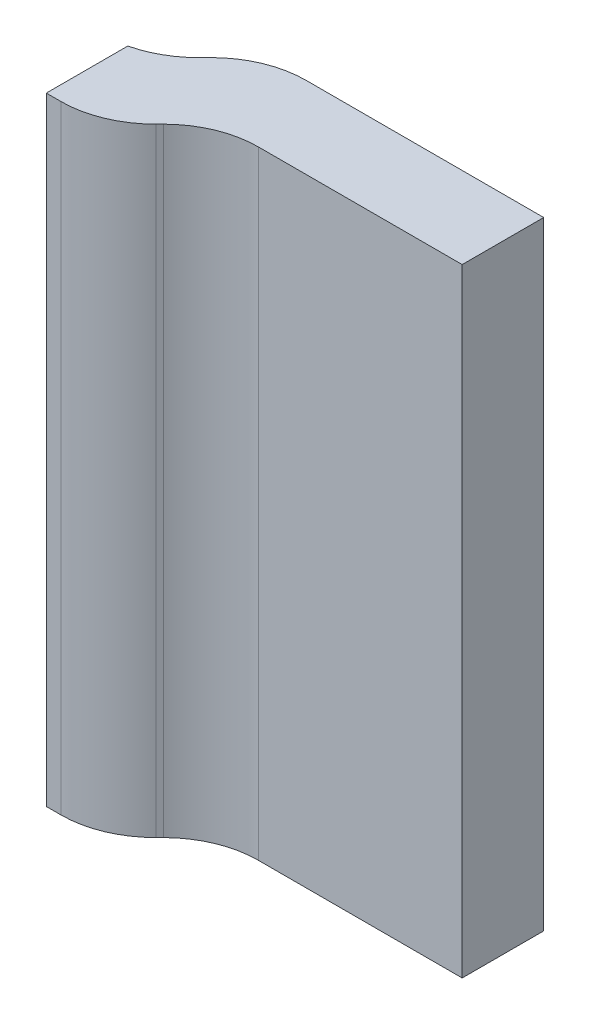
ISO-10303-21;
HEADER;
FILE_DESCRIPTION(('STEP AP214'),'2;1');
FILE_NAME('part.step','',(''),(''),'','','');
FILE_SCHEMA(('AUTOMOTIVE_DESIGN { 1 0 10303 214 1 1 1 1 }'));
ENDSEC;
DATA;
#1=APPLICATION_CONTEXT('core data for automotive mechanical design processes');
#2=APPLICATION_PROTOCOL_DEFINITION('international standard','automotive_design',2000,#1);
#3=PRODUCT_CONTEXT('',#1,'mechanical');
#4=PRODUCT('Part','Part','',(#3));
#5=PRODUCT_RELATED_PRODUCT_CATEGORY('part','',(#4));
#6=PRODUCT_DEFINITION_FORMATION('','',#4);
#7=PRODUCT_DEFINITION_CONTEXT('part definition',#1,'design');
#8=PRODUCT_DEFINITION('design','',#6,#7);
#9=PRODUCT_DEFINITION_SHAPE('','',#8);
#10=(LENGTH_UNIT() NAMED_UNIT(*) SI_UNIT(.MILLI.,.METRE.));
#11=(NAMED_UNIT(*) PLANE_ANGLE_UNIT() SI_UNIT($,.RADIAN.));
#12=(NAMED_UNIT(*) SI_UNIT($,.STERADIAN.) SOLID_ANGLE_UNIT());
#13=UNCERTAINTY_MEASURE_WITH_UNIT(LENGTH_MEASURE(1.E-05),#10,'distance_accuracy_value','');
#14=(GEOMETRIC_REPRESENTATION_CONTEXT(3) GLOBAL_UNCERTAINTY_ASSIGNED_CONTEXT((#13)) GLOBAL_UNIT_ASSIGNED_CONTEXT((#10,
#11,#12)) REPRESENTATION_CONTEXT('',''));
#15=CARTESIAN_POINT('',(0.,0.,0.));
#16=DIRECTION('',(0.,0.,1.));
#17=DIRECTION('',(1.,0.,0.));
#18=AXIS2_PLACEMENT_3D('',#15,#16,#17);
#19=CARTESIAN_POINT('',(2.,0.,1.186));
#20=DIRECTION('',(0.,0.,1.));
#21=DIRECTION('',(1.,0.,0.));
#22=AXIS2_PLACEMENT_3D('',#19,#20,#21);
#23=PLANE('',#22);
#24=DIRECTION('',(0.,1.,0.));
#25=VECTOR('',#24,1.);
#26=CARTESIAN_POINT('',(2.,0.,1.186));
#27=LINE('',#26,#25);
#28=CARTESIAN_POINT('',(2.,0.,1.186));
#29=VERTEX_POINT('',#28);
#30=CARTESIAN_POINT('',(2.,5.2,1.186));
#31=VERTEX_POINT('',#30);
#32=EDGE_CURVE('E117',#29,#31,#27,.T.);
#33=ORIENTED_EDGE('',*,*,#32,.F.);
#34=DIRECTION('',(1.,0.,0.));
#35=VECTOR('',#34,1.);
#36=CARTESIAN_POINT('',(2.,0.,1.186));
#37=LINE('',#36,#35);
#38=CARTESIAN_POINT('',(2.121779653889,0.,1.186));
#39=VERTEX_POINT('',#38);
#40=EDGE_CURVE('E105',#29,#39,#37,.T.);
#41=ORIENTED_EDGE('',*,*,#40,.T.);
#42=DIRECTION('',(0.,1.,0.));
#43=VECTOR('',#42,1.);
#44=CARTESIAN_POINT('',(2.121779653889,0.,1.186));
#45=LINE('',#44,#43);
#46=CARTESIAN_POINT('',(2.121779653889,5.2,1.186));
#47=VERTEX_POINT('',#46);
#48=EDGE_CURVE('E111',#39,#47,#45,.T.);
#49=ORIENTED_EDGE('',*,*,#48,.T.);
#50=DIRECTION('',(1.,0.,0.));
#51=VECTOR('',#50,1.);
#52=CARTESIAN_POINT('',(2.,5.2,1.186));
#53=LINE('',#52,#51);
#54=EDGE_CURVE('E114',#47,#31,#53,.F.);
#55=ORIENTED_EDGE('',*,*,#54,.T.);
#56=EDGE_LOOP('',(#33,#41,#49,#55));
#57=FACE_BOUND('',#56,.T.);
#58=ADVANCED_FACE('F17',(#57),#23,.T.);
#59=CARTESIAN_POINT('',(2.121779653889,0.,0.386));
#60=DIRECTION('',(0.,1.,0.));
#61=DIRECTION('',(0.,0.,1.));
#62=AXIS2_PLACEMENT_3D('',#59,#60,#61);
#63=CYLINDRICAL_SURFACE('',#62,0.8);
#64=DIRECTION('',(0.,1.,0.));
#65=VECTOR('',#64,1.);
#66=CARTESIAN_POINT('',(2.687465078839,0.,0.951685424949));
#67=LINE('',#66,#65);
#68=CARTESIAN_POINT('',(2.68746507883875,5.2,0.95168542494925));
#69=VERTEX_POINT('',#68);
#70=CARTESIAN_POINT('',(2.68746507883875,0.,0.95168542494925));
#71=VERTEX_POINT('',#70);
#72=EDGE_CURVE('E157',#69,#71,#67,.F.);
#73=ORIENTED_EDGE('',*,*,#72,.F.);
#74=CARTESIAN_POINT('',(2.121779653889,5.2,0.386));
#75=DIRECTION('',(0.,1.,0.));
#76=DIRECTION('',(0.,0.,1.));
#77=AXIS2_PLACEMENT_3D('',#74,#75,#76);
#78=CIRCLE('',#77,0.8);
#79=EDGE_CURVE('E98',#69,#47,#78,.F.);
#80=ORIENTED_EDGE('',*,*,#79,.T.);
#81=ORIENTED_EDGE('',*,*,#48,.F.);
#82=CARTESIAN_POINT('',(2.121779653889,0.,0.386));
#83=DIRECTION('',(0.,1.,0.));
#84=DIRECTION('',(0.,0.,1.));
#85=AXIS2_PLACEMENT_3D('',#82,#83,#84);
#86=CIRCLE('',#85,0.8);
#87=EDGE_CURVE('E20',#39,#71,#86,.T.);
#88=ORIENTED_EDGE('',*,*,#87,.T.);
#89=EDGE_LOOP('',(#73,#80,#81,#88));
#90=FACE_BOUND('',#89,.T.);
#91=ADVANCED_FACE('F112',(#90),#63,.T.);
#92=CARTESIAN_POINT('',(2.,0.,0.5));
#93=DIRECTION('',(-1.,0.,0.));
#94=DIRECTION('',(0.,0.,1.));
#95=AXIS2_PLACEMENT_3D('',#92,#93,#94);
#96=PLANE('',#95);
#97=DIRECTION('',(0.,0.,1.));
#98=VECTOR('',#97,1.);
#99=CARTESIAN_POINT('',(2.,5.2,0.5));
#100=LINE('',#99,#98);
#101=CARTESIAN_POINT('',(1.99999999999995,5.2,0.499999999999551));
#102=VERTEX_POINT('',#101);
#103=EDGE_CURVE('E149',#31,#102,#100,.F.);
#104=ORIENTED_EDGE('',*,*,#103,.T.);
#105=DIRECTION('',(0.,1.,0.));
#106=VECTOR('',#105,1.);
#107=CARTESIAN_POINT('',(1.9999999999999,0.,0.499999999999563));
#108=LINE('',#107,#106);
#109=CARTESIAN_POINT('',(1.99999999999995,0.,0.499999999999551));
#110=VERTEX_POINT('',#109);
#111=EDGE_CURVE('E144',#102,#110,#108,.F.);
#112=ORIENTED_EDGE('',*,*,#111,.T.);
#113=DIRECTION('',(0.,0.,1.));
#114=VECTOR('',#113,1.);
#115=CARTESIAN_POINT('',(2.,0.,0.5));
#116=LINE('',#115,#114);
#117=EDGE_CURVE('E145',#110,#29,#116,.T.);
#118=ORIENTED_EDGE('',*,*,#117,.T.);
#119=ORIENTED_EDGE('',*,*,#32,.T.);
#120=EDGE_LOOP('',(#104,#112,#118,#119));
#121=FACE_BOUND('',#120,.T.);
#122=ADVANCED_FACE('F320',(#121),#96,.T.);
#123=CARTESIAN_POINT('',(2.453150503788,0.,1.186));
#124=DIRECTION('',(0.707106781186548,0.,0.707106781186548));
#125=DIRECTION('',(0.707106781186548,0.,-0.707106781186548));
#126=AXIS2_PLACEMENT_3D('',#123,#124,#125);
#127=PLANE('',#126);
#128=DIRECTION('',(0.,1.,0.));
#129=VECTOR('',#128,1.);
#130=CARTESIAN_POINT('',(2.71883592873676,0.,0.920314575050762));
#131=LINE('',#130,#129);
#132=CARTESIAN_POINT('',(2.71883592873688,0.,0.920314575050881));
#133=VERTEX_POINT('',#132);
#134=CARTESIAN_POINT('',(2.71883592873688,5.2,0.920314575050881));
#135=VERTEX_POINT('',#134);
#136=EDGE_CURVE('E142',#133,#135,#131,.T.);
#137=ORIENTED_EDGE('',*,*,#136,.T.);
#138=DIRECTION('',(0.707106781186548,0.,-0.707106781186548));
#139=VECTOR('',#138,1.);
#140=CARTESIAN_POINT('',(2.453150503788,5.2,1.186));
#141=LINE('',#140,#139);
#142=EDGE_CURVE('E162',#135,#69,#141,.F.);
#143=ORIENTED_EDGE('',*,*,#142,.T.);
#144=ORIENTED_EDGE('',*,*,#72,.T.);
#145=DIRECTION('',(0.707106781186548,0.,-0.707106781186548));
#146=VECTOR('',#145,1.);
#147=CARTESIAN_POINT('',(2.453150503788,0.,1.186));
#148=LINE('',#147,#146);
#149=EDGE_CURVE('E108',#71,#133,#148,.T.);
#150=ORIENTED_EDGE('',*,*,#149,.T.);
#151=EDGE_LOOP('',(#137,#143,#144,#150));
#152=FACE_BOUND('',#151,.T.);
#153=ADVANCED_FACE('F310',(#152),#127,.T.);
#154=CARTESIAN_POINT('',(1.816237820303,0.,-0.278608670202));
#155=DIRECTION('',(0.,1.,0.));
#156=DIRECTION('',(0.,0.,1.));
#157=AXIS2_PLACEMENT_3D('',#154,#155,#156);
#158=CYLINDRICAL_SURFACE('',#157,0.8);
#159=DIRECTION('',(0.,1.,0.));
#160=VECTOR('',#159,1.);
#161=CARTESIAN_POINT('',(2.381923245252,0.,0.287076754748));
#162=LINE('',#161,#160);
#163=CARTESIAN_POINT('',(2.38192324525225,0.,0.28707675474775));
#164=VERTEX_POINT('',#163);
#165=CARTESIAN_POINT('',(2.38192324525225,5.2,0.28707675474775));
#166=VERTEX_POINT('',#165);
#167=EDGE_CURVE('E171',#164,#166,#162,.T.);
#168=ORIENTED_EDGE('',*,*,#167,.F.);
#169=CARTESIAN_POINT('',(1.816237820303,0.,-0.278608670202));
#170=DIRECTION('',(0.,1.,0.));
#171=DIRECTION('',(0.,0.,1.));
#172=AXIS2_PLACEMENT_3D('',#169,#170,#171);
#173=CIRCLE('',#172,0.8);
#174=EDGE_CURVE('E143',#110,#164,#173,.T.);
#175=ORIENTED_EDGE('',*,*,#174,.F.);
#176=ORIENTED_EDGE('',*,*,#111,.F.);
#177=CARTESIAN_POINT('',(1.816237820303,5.2,-0.278608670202));
#178=DIRECTION('',(0.,1.,0.));
#179=DIRECTION('',(0.,0.,1.));
#180=AXIS2_PLACEMENT_3D('',#177,#178,#179);
#181=CIRCLE('',#180,0.8);
#182=EDGE_CURVE('E139',#166,#102,#181,.F.);
#183=ORIENTED_EDGE('',*,*,#182,.F.);
#184=EDGE_LOOP('',(#168,#175,#176,#183));
#185=FACE_BOUND('',#184,.T.);
#186=ADVANCED_FACE('F301',(#185),#158,.F.);
#187=CARTESIAN_POINT('',(2.669,0.,0.));
#188=DIRECTION('',(-0.707106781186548,0.,-0.707106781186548));
#189=DIRECTION('',(-0.707106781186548,0.,0.707106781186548));
#190=AXIS2_PLACEMENT_3D('',#187,#188,#189);
#191=PLANE('',#190);
#192=ORIENTED_EDGE('',*,*,#167,.T.);
#193=DIRECTION('',(-0.707106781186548,0.,0.707106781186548));
#194=VECTOR('',#193,1.);
#195=CARTESIAN_POINT('',(2.669,5.2,0.));
#196=LINE('',#195,#194);
#197=CARTESIAN_POINT('',(2.43468542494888,5.2,0.234314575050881));
#198=VERTEX_POINT('',#197);
#199=EDGE_CURVE('E138',#166,#198,#196,.F.);
#200=ORIENTED_EDGE('',*,*,#199,.T.);
#201=DIRECTION('',(0.,1.,0.));
#202=VECTOR('',#201,1.);
#203=CARTESIAN_POINT('',(2.43468542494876,0.,0.234314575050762));
#204=LINE('',#203,#202);
#205=CARTESIAN_POINT('',(2.43468542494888,0.,0.234314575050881));
#206=VERTEX_POINT('',#205);
#207=EDGE_CURVE('E135',#206,#198,#204,.T.);
#208=ORIENTED_EDGE('',*,*,#207,.F.);
#209=DIRECTION('',(-0.707106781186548,0.,0.707106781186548));
#210=VECTOR('',#209,1.);
#211=CARTESIAN_POINT('',(2.669,0.,0.));
#212=LINE('',#211,#210);
#213=EDGE_CURVE('E170',#206,#164,#212,.T.);
#214=ORIENTED_EDGE('',*,*,#213,.T.);
#215=EDGE_LOOP('',(#192,#200,#208,#214));
#216=FACE_BOUND('',#215,.T.);
#217=ADVANCED_FACE('F224',(#216),#191,.T.);
#218=CARTESIAN_POINT('',(3.284521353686,0.,1.486));
#219=DIRECTION('',(0.,1.,0.));
#220=DIRECTION('',(0.,0.,1.));
#221=AXIS2_PLACEMENT_3D('',#218,#219,#220);
#222=CYLINDRICAL_SURFACE('',#221,0.8);
#223=CARTESIAN_POINT('',(3.284521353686,0.,1.486));
#224=DIRECTION('',(0.,1.,0.));
#225=DIRECTION('',(0.,0.,1.));
#226=AXIS2_PLACEMENT_3D('',#223,#224,#225);
#227=CIRCLE('',#226,0.8);
#228=CARTESIAN_POINT('',(3.284521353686,0.,0.686));
#229=VERTEX_POINT('',#228);
#230=EDGE_CURVE('E133',#229,#133,#227,.T.);
#231=ORIENTED_EDGE('',*,*,#230,.F.);
#232=DIRECTION('',(0.,-1.,0.));
#233=VECTOR('',#232,1.);
#234=CARTESIAN_POINT('',(3.284521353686,0.,0.686));
#235=LINE('',#234,#233);
#236=CARTESIAN_POINT('',(3.284521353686,5.2,0.686));
#237=VERTEX_POINT('',#236);
#238=EDGE_CURVE('E180',#237,#229,#235,.T.);
#239=ORIENTED_EDGE('',*,*,#238,.F.);
#240=CARTESIAN_POINT('',(3.284521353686,5.2,1.486));
#241=DIRECTION('',(0.,1.,0.));
#242=DIRECTION('',(0.,0.,1.));
#243=AXIS2_PLACEMENT_3D('',#240,#241,#242);
#244=CIRCLE('',#243,0.8);
#245=EDGE_CURVE('E136',#135,#237,#244,.F.);
#246=ORIENTED_EDGE('',*,*,#245,.F.);
#247=ORIENTED_EDGE('',*,*,#136,.F.);
#248=EDGE_LOOP('',(#231,#239,#246,#247));
#249=FACE_BOUND('',#248,.T.);
#250=ADVANCED_FACE('F282',(#249),#222,.F.);
#251=CARTESIAN_POINT('',(2.953150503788,0.,0.686));
#252=DIRECTION('',(0.,0.,1.));
#253=DIRECTION('',(0.,-1.,0.));
#254=AXIS2_PLACEMENT_3D('',#251,#252,#253);
#255=PLANE('',#254);
#256=DIRECTION('',(0.,1.,0.));
#257=VECTOR('',#256,1.);
#258=CARTESIAN_POINT('',(5.,0.,0.686));
#259=LINE('',#258,#257);
#260=CARTESIAN_POINT('',(5.,5.2,0.686));
#261=VERTEX_POINT('',#260);
#262=CARTESIAN_POINT('',(5.,0.,0.686));
#263=VERTEX_POINT('',#262);
#264=EDGE_CURVE('E189',#261,#263,#259,.F.);
#265=ORIENTED_EDGE('',*,*,#264,.F.);
#266=DIRECTION('',(1.,0.,0.));
#267=VECTOR('',#266,1.);
#268=CARTESIAN_POINT('',(3.450050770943,5.2,0.686));
#269=LINE('',#268,#267);
#270=EDGE_CURVE('E132',#237,#261,#269,.T.);
#271=ORIENTED_EDGE('',*,*,#270,.F.);
#272=ORIENTED_EDGE('',*,*,#238,.T.);
#273=DIRECTION('',(1.,0.,0.));
#274=VECTOR('',#273,1.);
#275=CARTESIAN_POINT('',(2.953150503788,0.,0.686));
#276=LINE('',#275,#274);
#277=EDGE_CURVE('E183',#229,#263,#276,.T.);
#278=ORIENTED_EDGE('',*,*,#277,.T.);
#279=EDGE_LOOP('',(#265,#271,#272,#278));
#280=FACE_BOUND('',#279,.T.);
#281=ADVANCED_FACE('F273',(#280),#255,.T.);
#282=CARTESIAN_POINT('',(3.000370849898,0.,0.8));
#283=DIRECTION('',(0.,1.,0.));
#284=DIRECTION('',(0.,0.,1.));
#285=AXIS2_PLACEMENT_3D('',#282,#283,#284);
#286=CYLINDRICAL_SURFACE('',#285,0.8);
#287=CARTESIAN_POINT('',(3.000370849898,5.2,0.8));
#288=DIRECTION('',(0.,1.,0.));
#289=DIRECTION('',(0.,0.,1.));
#290=AXIS2_PLACEMENT_3D('',#287,#288,#289);
#291=CIRCLE('',#290,0.8);
#292=CARTESIAN_POINT('',(3.000370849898,5.2,0.));
#293=VERTEX_POINT('',#292);
#294=EDGE_CURVE('E129',#293,#198,#291,.T.);
#295=ORIENTED_EDGE('',*,*,#294,.F.);
#296=DIRECTION('',(0.,1.,0.));
#297=VECTOR('',#296,1.);
#298=CARTESIAN_POINT('',(3.000370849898,0.,0.));
#299=LINE('',#298,#297);
#300=CARTESIAN_POINT('',(3.000370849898,0.,0.));
#301=VERTEX_POINT('',#300);
#302=EDGE_CURVE('E128',#301,#293,#299,.T.);
#303=ORIENTED_EDGE('',*,*,#302,.F.);
#304=CARTESIAN_POINT('',(3.000370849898,0.,0.8));
#305=DIRECTION('',(0.,1.,0.));
#306=DIRECTION('',(0.,0.,1.));
#307=AXIS2_PLACEMENT_3D('',#304,#305,#306);
#308=CIRCLE('',#307,0.8);
#309=EDGE_CURVE('E126',#301,#206,#308,.T.);
#310=ORIENTED_EDGE('',*,*,#309,.T.);
#311=ORIENTED_EDGE('',*,*,#207,.T.);
#312=EDGE_LOOP('',(#295,#303,#310,#311));
#313=FACE_BOUND('',#312,.T.);
#314=ADVANCED_FACE('F218',(#313),#286,.T.);
#315=CARTESIAN_POINT('',(3.450050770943,5.2,0.472411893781));
#316=DIRECTION('',(0.,1.,0.));
#317=DIRECTION('',(0.,0.,1.));
#318=AXIS2_PLACEMENT_3D('',#315,#316,#317);
#319=PLANE('',#318);
#320=ORIENTED_EDGE('',*,*,#54,.F.);
#321=ORIENTED_EDGE('',*,*,#79,.F.);
#322=ORIENTED_EDGE('',*,*,#142,.F.);
#323=ORIENTED_EDGE('',*,*,#245,.T.);
#324=ORIENTED_EDGE('',*,*,#270,.T.);
#325=DIRECTION('',(0.,0.,-1.));
#326=VECTOR('',#325,1.);
#327=CARTESIAN_POINT('',(5.,5.2,0.686));
#328=LINE('',#327,#326);
#329=CARTESIAN_POINT('',(5.,5.2,0.));
#330=VERTEX_POINT('',#329);
#331=EDGE_CURVE('E131',#330,#261,#328,.F.);
#332=ORIENTED_EDGE('',*,*,#331,.F.);
#333=DIRECTION('',(-1.,0.,0.));
#334=VECTOR('',#333,1.);
#335=CARTESIAN_POINT('',(5.,5.2,0.));
#336=LINE('',#335,#334);
#337=EDGE_CURVE('E196',#293,#330,#336,.F.);
#338=ORIENTED_EDGE('',*,*,#337,.F.);
#339=ORIENTED_EDGE('',*,*,#294,.T.);
#340=ORIENTED_EDGE('',*,*,#199,.F.);
#341=ORIENTED_EDGE('',*,*,#182,.T.);
#342=ORIENTED_EDGE('',*,*,#103,.F.);
#343=EDGE_LOOP('',(#320,#321,#322,#323,#324,#332,#338,#339,#340,#341,#342));
#344=FACE_BOUND('',#343,.T.);
#345=ADVANCED_FACE('F227',(#344),#319,.T.);
#346=CARTESIAN_POINT('',(5.,0.,0.686));
#347=DIRECTION('',(1.,0.,0.));
#348=DIRECTION('',(0.,0.,-1.));
#349=AXIS2_PLACEMENT_3D('',#346,#347,#348);
#350=PLANE('',#349);
#351=ORIENTED_EDGE('',*,*,#331,.T.);
#352=ORIENTED_EDGE('',*,*,#264,.T.);
#353=DIRECTION('',(0.,0.,1.));
#354=VECTOR('',#353,1.);
#355=CARTESIAN_POINT('',(5.,0.,0.472411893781));
#356=LINE('',#355,#354);
#357=CARTESIAN_POINT('',(5.,0.,0.));
#358=VERTEX_POINT('',#357);
#359=EDGE_CURVE('E35',#263,#358,#356,.F.);
#360=ORIENTED_EDGE('',*,*,#359,.T.);
#361=DIRECTION('',(0.,1.,0.));
#362=VECTOR('',#361,1.);
#363=CARTESIAN_POINT('',(5.,0.,0.));
#364=LINE('',#363,#362);
#365=EDGE_CURVE('E26',#330,#358,#364,.F.);
#366=ORIENTED_EDGE('',*,*,#365,.F.);
#367=EDGE_LOOP('',(#351,#352,#360,#366));
#368=FACE_BOUND('',#367,.T.);
#369=ADVANCED_FACE('F231',(#368),#350,.T.);
#370=CARTESIAN_POINT('',(3.450050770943,0.,0.472411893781));
#371=DIRECTION('',(0.,1.,0.));
#372=DIRECTION('',(0.,0.,1.));
#373=AXIS2_PLACEMENT_3D('',#370,#371,#372);
#374=PLANE('',#373);
#375=ORIENTED_EDGE('',*,*,#40,.F.);
#376=ORIENTED_EDGE('',*,*,#117,.F.);
#377=ORIENTED_EDGE('',*,*,#174,.T.);
#378=ORIENTED_EDGE('',*,*,#213,.F.);
#379=ORIENTED_EDGE('',*,*,#309,.F.);
#380=DIRECTION('',(-1.,0.,0.));
#381=VECTOR('',#380,1.);
#382=CARTESIAN_POINT('',(5.,0.,0.));
#383=LINE('',#382,#381);
#384=EDGE_CURVE('E11',#358,#301,#383,.T.);
#385=ORIENTED_EDGE('',*,*,#384,.F.);
#386=ORIENTED_EDGE('',*,*,#359,.F.);
#387=ORIENTED_EDGE('',*,*,#277,.F.);
#388=ORIENTED_EDGE('',*,*,#230,.T.);
#389=ORIENTED_EDGE('',*,*,#149,.F.);
#390=ORIENTED_EDGE('',*,*,#87,.F.);
#391=EDGE_LOOP('',(#375,#376,#377,#378,#379,#385,#386,#387,#388,#389,#390));
#392=FACE_BOUND('',#391,.T.);
#393=ADVANCED_FACE('F103',(#392),#374,.F.);
#394=CARTESIAN_POINT('',(5.,0.,0.));
#395=DIRECTION('',(0.,0.,-1.));
#396=DIRECTION('',(-1.,0.,0.));
#397=AXIS2_PLACEMENT_3D('',#394,#395,#396);
#398=PLANE('',#397);
#399=ORIENTED_EDGE('',*,*,#365,.T.);
#400=ORIENTED_EDGE('',*,*,#384,.T.);
#401=ORIENTED_EDGE('',*,*,#302,.T.);
#402=ORIENTED_EDGE('',*,*,#337,.T.);
#403=EDGE_LOOP('',(#399,#400,#401,#402));
#404=FACE_BOUND('',#403,.T.);
#405=ADVANCED_FACE('F214',(#404),#398,.T.);
#406=CLOSED_SHELL('',(#58,#91,#122,#153,#186,#217,#250,#281,#314,#345,#369,#393,#405));
#407=MANIFOLD_SOLID_BREP('B1',#406);
#408=ADVANCED_BREP_SHAPE_REPRESENTATION('',(#18,#407),#14);
#409=SHAPE_DEFINITION_REPRESENTATION(#9,#408);
ENDSEC;
END-ISO-10303-21;
